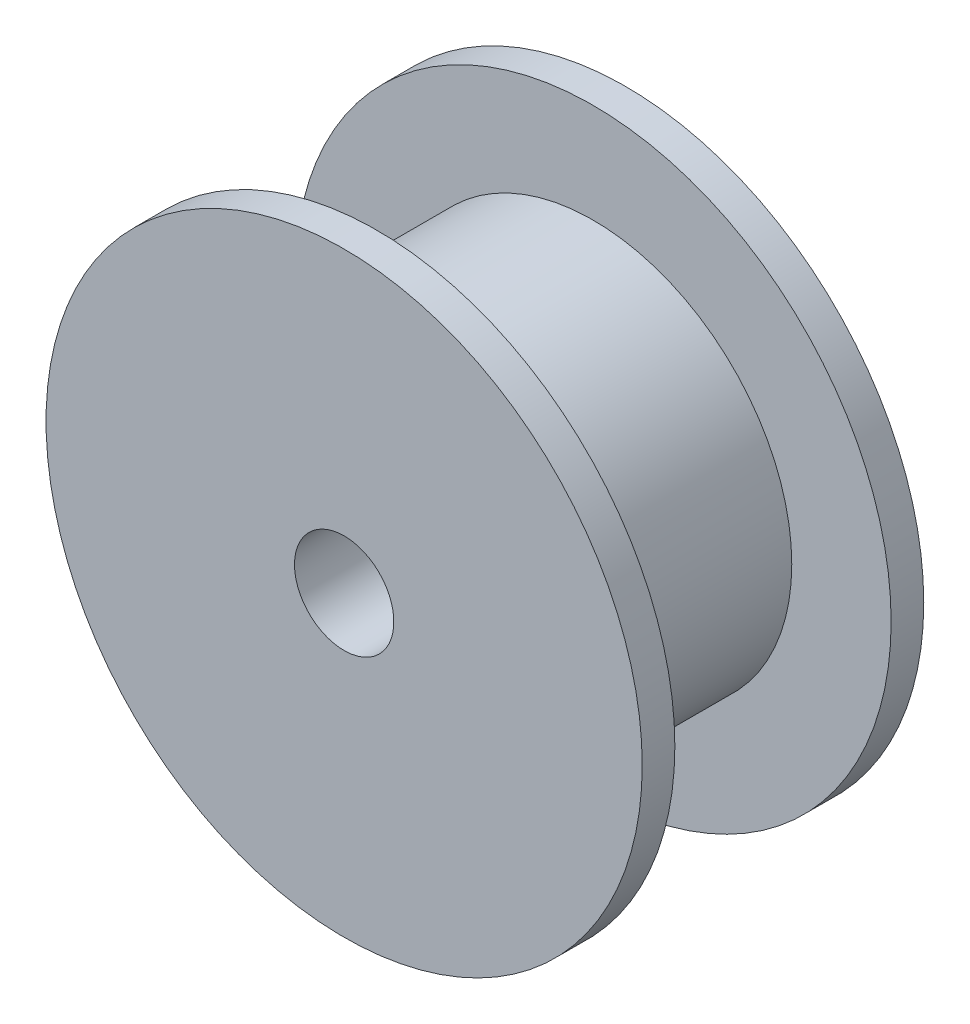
ISO-10303-21;
HEADER;
FILE_DESCRIPTION(('STEP AP214'),'2;1');
FILE_NAME('part.step','',(''),(''),'','','');
FILE_SCHEMA(('AUTOMOTIVE_DESIGN { 1 0 10303 214 1 1 1 1 }'));
ENDSEC;
DATA;
#1=APPLICATION_CONTEXT('core data for automotive mechanical design processes');
#2=APPLICATION_PROTOCOL_DEFINITION('international standard','automotive_design',2000,#1);
#3=PRODUCT_CONTEXT('',#1,'mechanical');
#4=PRODUCT('Part','Part','',(#3));
#5=PRODUCT_RELATED_PRODUCT_CATEGORY('part','',(#4));
#6=PRODUCT_DEFINITION_FORMATION('','',#4);
#7=PRODUCT_DEFINITION_CONTEXT('part definition',#1,'design');
#8=PRODUCT_DEFINITION('design','',#6,#7);
#9=PRODUCT_DEFINITION_SHAPE('','',#8);
#10=(LENGTH_UNIT() NAMED_UNIT(*) SI_UNIT(.MILLI.,.METRE.));
#11=(NAMED_UNIT(*) PLANE_ANGLE_UNIT() SI_UNIT($,.RADIAN.));
#12=(NAMED_UNIT(*) SI_UNIT($,.STERADIAN.) SOLID_ANGLE_UNIT());
#13=UNCERTAINTY_MEASURE_WITH_UNIT(LENGTH_MEASURE(1.E-05),#10,'distance_accuracy_value','');
#14=(GEOMETRIC_REPRESENTATION_CONTEXT(3) GLOBAL_UNCERTAINTY_ASSIGNED_CONTEXT((#13)) GLOBAL_UNIT_ASSIGNED_CONTEXT((#10,
#11,#12)) REPRESENTATION_CONTEXT('',''));
#15=CARTESIAN_POINT('',(0.,0.,0.));
#16=DIRECTION('',(0.,0.,1.));
#17=DIRECTION('',(1.,0.,0.));
#18=AXIS2_PLACEMENT_3D('',#15,#16,#17);
#19=CARTESIAN_POINT('',(0.,0.,0.));
#20=DIRECTION('',(0.,0.,-1.));
#21=DIRECTION('',(-1.,0.,0.));
#22=AXIS2_PLACEMENT_3D('',#19,#20,#21);
#23=PLANE('',#22);
#24=CARTESIAN_POINT('',(0.,0.,0.));
#25=DIRECTION('',(0.,0.,-1.));
#26=DIRECTION('',(-1.,0.,0.));
#27=AXIS2_PLACEMENT_3D('',#24,#25,#26);
#28=CIRCLE('',#27,1.5);
#29=CARTESIAN_POINT('',(-1.5,0.,0.));
#30=VERTEX_POINT('',#29);
#31=EDGE_CURVE('E60',#30,#30,#28,.T.);
#32=ORIENTED_EDGE('',*,*,#31,.T.);
#33=EDGE_LOOP('',(#32));
#34=FACE_BOUND('',#33,.T.);
#35=CARTESIAN_POINT('',(0.,0.,0.));
#36=DIRECTION('',(0.,0.,1.));
#37=DIRECTION('',(1.,0.,0.));
#38=AXIS2_PLACEMENT_3D('',#35,#36,#37);
#39=CIRCLE('',#38,9.);
#40=CARTESIAN_POINT('',(9.,0.,0.));
#41=VERTEX_POINT('',#40);
#42=EDGE_CURVE('E10',#41,#41,#39,.T.);
#43=ORIENTED_EDGE('',*,*,#42,.T.);
#44=EDGE_LOOP('',(#43));
#45=FACE_BOUND('',#44,.T.);
#46=ADVANCED_FACE('F35',(#34,#45),#23,.F.);
#47=CARTESIAN_POINT('',(0.,0.,0.));
#48=DIRECTION('',(0.,0.,1.));
#49=DIRECTION('',(1.,0.,0.));
#50=AXIS2_PLACEMENT_3D('',#47,#48,#49);
#51=CYLINDRICAL_SURFACE('',#50,9.);
#52=ORIENTED_EDGE('',*,*,#42,.F.);
#53=EDGE_LOOP('',(#52));
#54=FACE_BOUND('',#53,.T.);
#55=CARTESIAN_POINT('',(0.,0.,-0.985));
#56=DIRECTION('',(0.,0.,1.));
#57=DIRECTION('',(1.,0.,0.));
#58=AXIS2_PLACEMENT_3D('',#55,#56,#57);
#59=CIRCLE('',#58,9.);
#60=CARTESIAN_POINT('',(9.,0.,-0.985));
#61=VERTEX_POINT('',#60);
#62=EDGE_CURVE('E41',#61,#61,#59,.T.);
#63=ORIENTED_EDGE('',*,*,#62,.T.);
#64=EDGE_LOOP('',(#63));
#65=FACE_BOUND('',#64,.T.);
#66=ADVANCED_FACE('F89',(#54,#65),#51,.T.);
#67=CARTESIAN_POINT('',(-9.,0.,-0.985));
#68=DIRECTION('',(0.,0.,1.));
#69=DIRECTION('',(1.,0.,0.));
#70=AXIS2_PLACEMENT_3D('',#67,#68,#69);
#71=PLANE('',#70);
#72=ORIENTED_EDGE('',*,*,#62,.F.);
#73=EDGE_LOOP('',(#72));
#74=FACE_BOUND('',#73,.T.);
#75=CARTESIAN_POINT('',(0.,0.,-0.985));
#76=DIRECTION('',(0.,0.,1.));
#77=DIRECTION('',(1.,0.,0.));
#78=AXIS2_PLACEMENT_3D('',#75,#76,#77);
#79=CIRCLE('',#78,6.);
#80=CARTESIAN_POINT('',(6.,0.,-0.985));
#81=VERTEX_POINT('',#80);
#82=EDGE_CURVE('E45',#81,#81,#79,.T.);
#83=ORIENTED_EDGE('',*,*,#82,.T.);
#84=EDGE_LOOP('',(#83));
#85=FACE_BOUND('',#84,.T.);
#86=ADVANCED_FACE('F94',(#74,#85),#71,.F.);
#87=CARTESIAN_POINT('',(0.,0.,0.));
#88=DIRECTION('',(0.,0.,1.));
#89=DIRECTION('',(1.,0.,0.));
#90=AXIS2_PLACEMENT_3D('',#87,#88,#89);
#91=CYLINDRICAL_SURFACE('',#90,6.);
#92=ORIENTED_EDGE('',*,*,#82,.F.);
#93=EDGE_LOOP('',(#92));
#94=FACE_BOUND('',#93,.T.);
#95=CARTESIAN_POINT('',(0.,0.,-7.515));
#96=DIRECTION('',(0.,0.,1.));
#97=DIRECTION('',(1.,0.,0.));
#98=AXIS2_PLACEMENT_3D('',#95,#96,#97);
#99=CIRCLE('',#98,6.);
#100=CARTESIAN_POINT('',(6.,0.,-7.515));
#101=VERTEX_POINT('',#100);
#102=EDGE_CURVE('E49',#101,#101,#99,.T.);
#103=ORIENTED_EDGE('',*,*,#102,.T.);
#104=EDGE_LOOP('',(#103));
#105=FACE_BOUND('',#104,.T.);
#106=ADVANCED_FACE('F84',(#94,#105),#91,.T.);
#107=CARTESIAN_POINT('',(-6.,0.,-7.515));
#108=DIRECTION('',(0.,0.,-1.));
#109=DIRECTION('',(-1.,0.,0.));
#110=AXIS2_PLACEMENT_3D('',#107,#108,#109);
#111=PLANE('',#110);
#112=ORIENTED_EDGE('',*,*,#102,.F.);
#113=EDGE_LOOP('',(#112));
#114=FACE_BOUND('',#113,.T.);
#115=CARTESIAN_POINT('',(0.,0.,-7.515));
#116=DIRECTION('',(0.,0.,1.));
#117=DIRECTION('',(1.,0.,0.));
#118=AXIS2_PLACEMENT_3D('',#115,#116,#117);
#119=CIRCLE('',#118,9.);
#120=CARTESIAN_POINT('',(9.,0.,-7.515));
#121=VERTEX_POINT('',#120);
#122=EDGE_CURVE('E54',#121,#121,#119,.T.);
#123=ORIENTED_EDGE('',*,*,#122,.T.);
#124=EDGE_LOOP('',(#123));
#125=FACE_BOUND('',#124,.T.);
#126=ADVANCED_FACE('F78',(#114,#125),#111,.F.);
#127=CARTESIAN_POINT('',(0.,0.,0.));
#128=DIRECTION('',(0.,0.,1.));
#129=DIRECTION('',(1.,0.,0.));
#130=AXIS2_PLACEMENT_3D('',#127,#128,#129);
#131=CYLINDRICAL_SURFACE('',#130,9.);
#132=ORIENTED_EDGE('',*,*,#122,.F.);
#133=EDGE_LOOP('',(#132));
#134=FACE_BOUND('',#133,.T.);
#135=CARTESIAN_POINT('',(0.,0.,-8.5));
#136=DIRECTION('',(0.,0.,1.));
#137=DIRECTION('',(1.,0.,0.));
#138=AXIS2_PLACEMENT_3D('',#135,#136,#137);
#139=CIRCLE('',#138,9.);
#140=CARTESIAN_POINT('',(9.,0.,-8.5));
#141=VERTEX_POINT('',#140);
#142=EDGE_CURVE('E57',#141,#141,#139,.T.);
#143=ORIENTED_EDGE('',*,*,#142,.T.);
#144=EDGE_LOOP('',(#143));
#145=FACE_BOUND('',#144,.T.);
#146=ADVANCED_FACE('F73',(#134,#145),#131,.T.);
#147=CARTESIAN_POINT('',(-9.,0.,-8.5));
#148=DIRECTION('',(0.,0.,1.));
#149=DIRECTION('',(1.,0.,0.));
#150=AXIS2_PLACEMENT_3D('',#147,#148,#149);
#151=PLANE('',#150);
#152=CARTESIAN_POINT('',(0.,0.,-8.5));
#153=DIRECTION('',(0.,0.,-1.));
#154=DIRECTION('',(-1.,0.,0.));
#155=AXIS2_PLACEMENT_3D('',#152,#153,#154);
#156=CIRCLE('',#155,1.5);
#157=CARTESIAN_POINT('',(-1.5,0.,-8.5));
#158=VERTEX_POINT('',#157);
#159=EDGE_CURVE('E63',#158,#158,#156,.T.);
#160=ORIENTED_EDGE('',*,*,#159,.F.);
#161=EDGE_LOOP('',(#160));
#162=FACE_BOUND('',#161,.T.);
#163=ORIENTED_EDGE('',*,*,#142,.F.);
#164=EDGE_LOOP('',(#163));
#165=FACE_BOUND('',#164,.T.);
#166=ADVANCED_FACE('F70',(#162,#165),#151,.F.);
#167=CARTESIAN_POINT('',(0.,0.,20.5));
#168=DIRECTION('',(0.,0.,-1.));
#169=DIRECTION('',(-1.,0.,0.));
#170=AXIS2_PLACEMENT_3D('',#167,#168,#169);
#171=CYLINDRICAL_SURFACE('',#170,1.5);
#172=ORIENTED_EDGE('',*,*,#159,.T.);
#173=EDGE_LOOP('',(#172));
#174=FACE_BOUND('',#173,.T.);
#175=ORIENTED_EDGE('',*,*,#31,.F.);
#176=EDGE_LOOP('',(#175));
#177=FACE_BOUND('',#176,.T.);
#178=ADVANCED_FACE('F67',(#174,#177),#171,.F.);
#179=CLOSED_SHELL('',(#46,#66,#86,#106,#126,#146,#166,#178));
#180=MANIFOLD_SOLID_BREP('B2',#179);
#181=ADVANCED_BREP_SHAPE_REPRESENTATION('',(#18,#180),#14);
#182=SHAPE_DEFINITION_REPRESENTATION(#9,#181);
ENDSEC;
END-ISO-10303-21;
